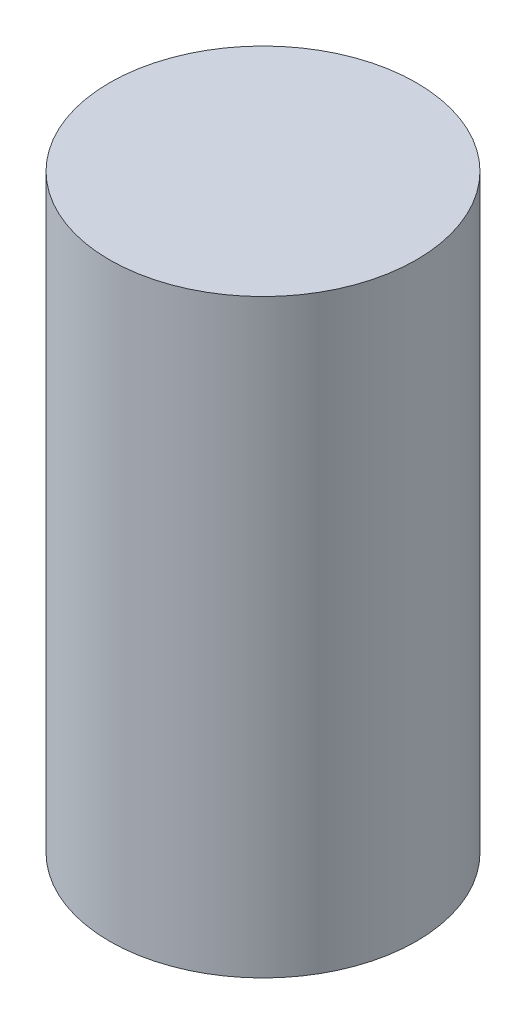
ISO-10303-21;
HEADER;
FILE_DESCRIPTION(('STEP AP214'),'2;1');
FILE_NAME('part.step','',(''),(''),'','','');
FILE_SCHEMA(('AUTOMOTIVE_DESIGN { 1 0 10303 214 1 1 1 1 }'));
ENDSEC;
DATA;
#1=APPLICATION_CONTEXT('core data for automotive mechanical design processes');
#2=APPLICATION_PROTOCOL_DEFINITION('international standard','automotive_design',2000,#1);
#3=PRODUCT_CONTEXT('',#1,'mechanical');
#4=PRODUCT('Part','Part','',(#3));
#5=PRODUCT_RELATED_PRODUCT_CATEGORY('part','',(#4));
#6=PRODUCT_DEFINITION_FORMATION('','',#4);
#7=PRODUCT_DEFINITION_CONTEXT('part definition',#1,'design');
#8=PRODUCT_DEFINITION('design','',#6,#7);
#9=PRODUCT_DEFINITION_SHAPE('','',#8);
#10=(LENGTH_UNIT() NAMED_UNIT(*) SI_UNIT(.MILLI.,.METRE.));
#11=(NAMED_UNIT(*) PLANE_ANGLE_UNIT() SI_UNIT($,.RADIAN.));
#12=(NAMED_UNIT(*) SI_UNIT($,.STERADIAN.) SOLID_ANGLE_UNIT());
#13=UNCERTAINTY_MEASURE_WITH_UNIT(LENGTH_MEASURE(1.E-05),#10,'distance_accuracy_value','');
#14=(GEOMETRIC_REPRESENTATION_CONTEXT(3) GLOBAL_UNCERTAINTY_ASSIGNED_CONTEXT((#13)) GLOBAL_UNIT_ASSIGNED_CONTEXT((#10,
#11,#12)) REPRESENTATION_CONTEXT('',''));
#15=CARTESIAN_POINT('',(0.,0.,0.));
#16=DIRECTION('',(0.,0.,1.));
#17=DIRECTION('',(1.,0.,0.));
#18=AXIS2_PLACEMENT_3D('',#15,#16,#17);
#19=CARTESIAN_POINT('',(3.60822483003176E-13,-158.75,0.));
#20=DIRECTION('',(0.,1.00000000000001,0.));
#21=DIRECTION('',(0.,0.,1.));
#22=AXIS2_PLACEMENT_3D('',#19,#20,#21);
#23=CYLINDRICAL_SURFACE('',#22,41.275);
#24=CARTESIAN_POINT('',(3.60822483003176E-13,-158.75,0.));
#25=DIRECTION('',(0.,1.00000000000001,0.));
#26=DIRECTION('',(0.,0.,1.));
#27=AXIS2_PLACEMENT_3D('',#24,#25,#26);
#28=CIRCLE('',#27,41.275);
#29=CARTESIAN_POINT('',(3.60822483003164E-13,-158.75,41.275));
#30=VERTEX_POINT('',#29);
#31=EDGE_CURVE('E10',#30,#30,#28,.T.);
#32=ORIENTED_EDGE('',*,*,#31,.T.);
#33=EDGE_LOOP('',(#32));
#34=FACE_BOUND('',#33,.T.);
#35=CARTESIAN_POINT('',(0.,0.,0.));
#36=DIRECTION('',(0.,1.00000000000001,0.));
#37=DIRECTION('',(0.,0.,1.));
#38=AXIS2_PLACEMENT_3D('',#35,#36,#37);
#39=CIRCLE('',#38,41.275);
#40=CARTESIAN_POINT('',(0.,0.,41.275));
#41=VERTEX_POINT('',#40);
#42=EDGE_CURVE('E33',#41,#41,#39,.T.);
#43=ORIENTED_EDGE('',*,*,#42,.F.);
#44=EDGE_LOOP('',(#43));
#45=FACE_BOUND('',#44,.T.);
#46=ADVANCED_FACE('F30',(#34,#45),#23,.T.);
#47=CARTESIAN_POINT('',(3.60822483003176E-13,-158.75,0.));
#48=DIRECTION('',(0.,1.00000000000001,0.));
#49=DIRECTION('',(0.,0.,1.));
#50=AXIS2_PLACEMENT_3D('',#47,#48,#49);
#51=PLANE('',#50);
#52=ORIENTED_EDGE('',*,*,#31,.F.);
#53=EDGE_LOOP('',(#52));
#54=FACE_BOUND('',#53,.T.);
#55=ADVANCED_FACE('F45',(#54),#51,.F.);
#56=CARTESIAN_POINT('',(0.,0.,0.));
#57=DIRECTION('',(0.,1.00000000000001,0.));
#58=DIRECTION('',(0.,0.,1.));
#59=AXIS2_PLACEMENT_3D('',#56,#57,#58);
#60=PLANE('',#59);
#61=ORIENTED_EDGE('',*,*,#42,.T.);
#62=EDGE_LOOP('',(#61));
#63=FACE_BOUND('',#62,.T.);
#64=ADVANCED_FACE('F42',(#63),#60,.T.);
#65=CLOSED_SHELL('',(#46,#55,#64));
#66=MANIFOLD_SOLID_BREP('B2',#65);
#67=ADVANCED_BREP_SHAPE_REPRESENTATION('',(#18,#66),#14);
#68=SHAPE_DEFINITION_REPRESENTATION(#9,#67);
ENDSEC;
END-ISO-10303-21;
